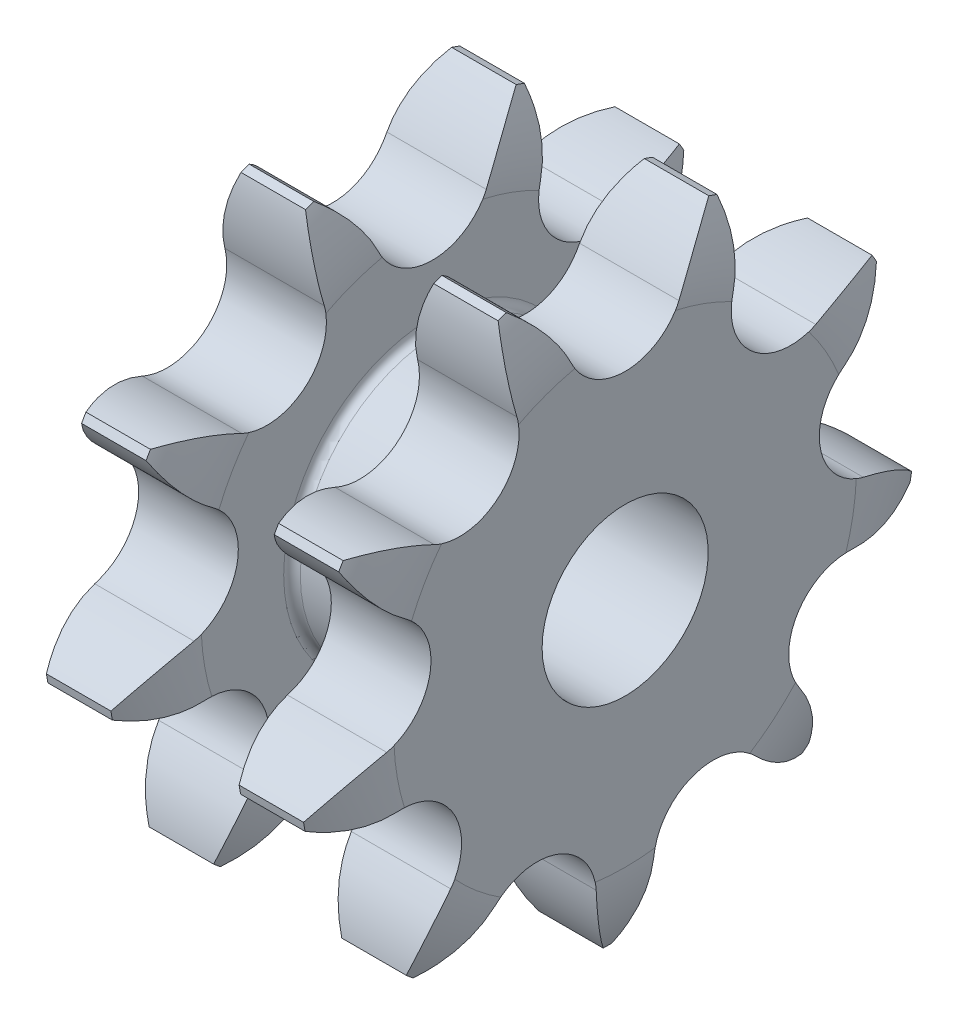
from build123d import *

# Parameters (mm, degrees)
TOOTHCUT_DEPTH  = 38.895381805
TEETHCUTS_COUNT = 9
TEETHCUTS_ANGLE = 320
BORSKE_R        = 6
BORE_DEPTH      = 23.3205


with BuildPart() as part:
    # BasProSke → Base-Revolve (revolve)
    with BuildSketch(Plane(origin=(0, 0, 0), x_dir=(1, 0, 0), z_dir=(0, 1, 0)), mode=Mode.PRIVATE) as base_revolve_sk:
        with BuildLine():
            Line((0, 0), (0, 16.712856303))
            ThreePointArc((0, 16.712856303), (0.321571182, 19.552662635), (1.27, 22.248657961))
            Line((1.27, 22.248657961), (19.85, 22.248657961))
            ThreePointArc((19.85, 22.248657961), (20.798428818, 19.552662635), (21.12, 16.712856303))
            Line((21.12, 16.712856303), (21.12, 0))
            Line((21.12, 0), (0, 0))
        make_face()
    revolve(base_revolve_sk.sketch.rotate(Axis((-10, 0, 0), (1, 0, 0)), 180), axis=Axis((-10, 0, 0), (1, 0, 0)))

    # GrvSke → Groove (revolve, cut)
    with BuildSketch(Plane(origin=(0, 0, 0), x_dir=(1, 0, 0), z_dir=(0, 1, 0)), mode=Mode.PRIVATE) as groove_sk:
        with BuildLine():
            Line((7.2, 16.712856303), (7.2, 10.751481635))
            ThreePointArc((7.2, 10.751481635), (7.375735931, 10.327217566), (7.8, 10.151481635))
            Line((7.8, 10.151481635), (13.32, 10.151481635))
            ThreePointArc((13.32, 10.151481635), (13.744264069, 10.327217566), (13.92, 10.751481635))
            Line((13.92, 10.751481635), (13.92, 16.712856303))
            ThreePointArc((13.92, 16.712856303), (14.241571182, 19.552662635), (15.19, 22.248657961))
            Line((15.19, 22.248657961), (5.93, 22.248657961))
            ThreePointArc((5.93, 22.248657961), (6.878428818, 19.552662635), (7.2, 16.712856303))
        make_face()
    revolve(groove_sk.sketch.rotate(Axis((0, 0, 0), (1, 0, 0)), 180), axis=Axis((0, 0, 0), (1, 0, 0)), mode=Mode.SUBTRACT)

    # TooCutSke → ToothCut (cut, through all)
    with BuildSketch(Plane(origin=(0, 0, 0), x_dir=(0, 0, -1), z_dir=(1, 0, 0))):
        with BuildLine():
            ThreePointArc((3.89490303, 16.792484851), (5.53909395, 19.346647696), (7.807509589, 21.366895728))
            ThreePointArc((7.807509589, 21.366895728), (0, 22.748657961), (-7.807509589, 21.366895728))
            ThreePointArc((-7.807509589, 21.366895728), (-5.53909395, 19.346647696), (-3.89490303, 16.792484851))
            ThreePointArc((-3.89490303, 16.792484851), (0, 14.311157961), (3.89490303, 16.792484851))
        make_face()
    toothcut = extrude(amount=TOOTHCUT_DEPTH, mode=Mode.SUBTRACT)

    # TeethCuts: ToothCut ×9 about axis
    teethcuts_axis = Axis((-10, 0, 0), (1, 0, 0))
    for i in range(1, TEETHCUTS_COUNT):
        add(toothcut.rotate(teethcuts_axis, i * TEETHCUTS_ANGLE / (TEETHCUTS_COUNT - 1)), mode=Mode.SUBTRACT)

    # BorSke → Bore (cut, symmetric)
    with BuildSketch(Plane(origin=(0, 0, 0), x_dir=(0, 0, -1), z_dir=(1, 0, 0))):
        with Locations(Location((0, 0, 0), (0, 0, 180))):
            Circle(BORSKE_R)
    extrude(amount=BORE_DEPTH, both=True, mode=Mode.SUBTRACT)


solid = part.part
